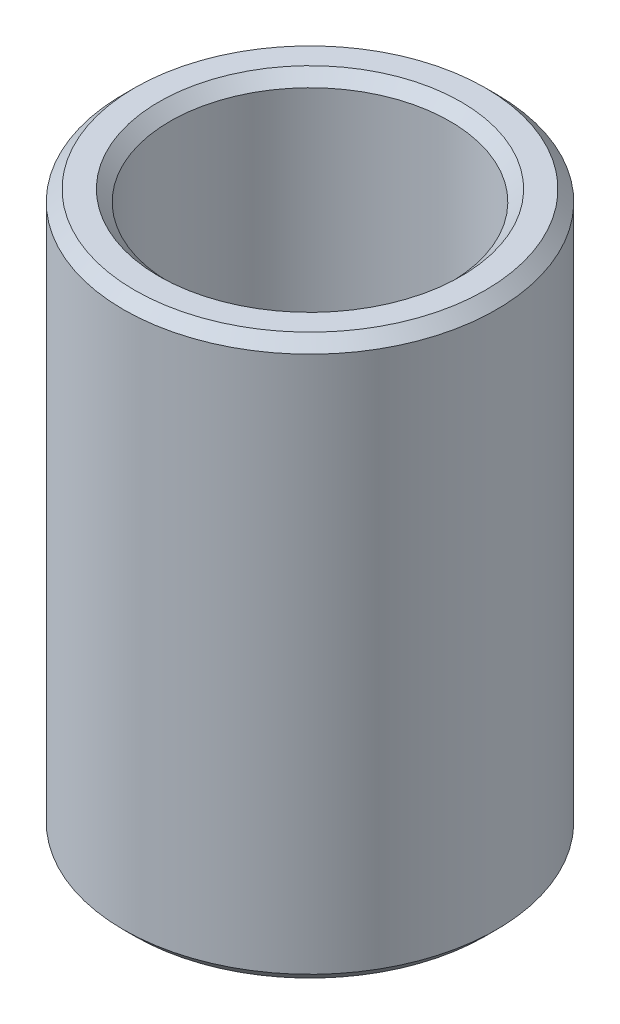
ISO-10303-21;
HEADER;
FILE_DESCRIPTION(('STEP AP214'),'2;1');
FILE_NAME('part.step','',(''),(''),'','','');
FILE_SCHEMA(('AUTOMOTIVE_DESIGN { 1 0 10303 214 1 1 1 1 }'));
ENDSEC;
DATA;
#1=APPLICATION_CONTEXT('core data for automotive mechanical design processes');
#2=APPLICATION_PROTOCOL_DEFINITION('international standard','automotive_design',2000,#1);
#3=PRODUCT_CONTEXT('',#1,'mechanical');
#4=PRODUCT('Part','Part','',(#3));
#5=PRODUCT_RELATED_PRODUCT_CATEGORY('part','',(#4));
#6=PRODUCT_DEFINITION_FORMATION('','',#4);
#7=PRODUCT_DEFINITION_CONTEXT('part definition',#1,'design');
#8=PRODUCT_DEFINITION('design','',#6,#7);
#9=PRODUCT_DEFINITION_SHAPE('','',#8);
#10=(LENGTH_UNIT() NAMED_UNIT(*) SI_UNIT(.MILLI.,.METRE.));
#11=(NAMED_UNIT(*) PLANE_ANGLE_UNIT() SI_UNIT($,.RADIAN.));
#12=(NAMED_UNIT(*) SI_UNIT($,.STERADIAN.) SOLID_ANGLE_UNIT());
#13=UNCERTAINTY_MEASURE_WITH_UNIT(LENGTH_MEASURE(1.E-05),#10,'distance_accuracy_value','');
#14=(GEOMETRIC_REPRESENTATION_CONTEXT(3) GLOBAL_UNCERTAINTY_ASSIGNED_CONTEXT((#13)) GLOBAL_UNIT_ASSIGNED_CONTEXT((#10,
#11,#12)) REPRESENTATION_CONTEXT('',''));
#15=CARTESIAN_POINT('',(0.,0.,0.));
#16=DIRECTION('',(0.,0.,1.));
#17=DIRECTION('',(1.,0.,0.));
#18=AXIS2_PLACEMENT_3D('',#15,#16,#17);
#19=CARTESIAN_POINT('',(0.,76.2,0.));
#20=DIRECTION('',(0.,1.,0.));
#21=DIRECTION('',(0.,0.,1.));
#22=AXIS2_PLACEMENT_3D('',#19,#20,#21);
#23=PLANE('',#22);
#24=CARTESIAN_POINT('',(0.,76.2,0.));
#25=DIRECTION('',(0.,1.,0.));
#26=DIRECTION('',(0.,0.,1.));
#27=AXIS2_PLACEMENT_3D('',#24,#25,#26);
#28=CIRCLE('',#27,23.8823500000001);
#29=CARTESIAN_POINT('',(0.,76.2,23.8823500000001));
#30=VERTEX_POINT('',#29);
#31=EDGE_CURVE('E54',#30,#30,#28,.T.);
#32=ORIENTED_EDGE('',*,*,#31,.T.);
#33=EDGE_LOOP('',(#32));
#34=FACE_BOUND('',#33,.T.);
#35=CARTESIAN_POINT('',(0.,76.2,0.));
#36=DIRECTION('',(0.,1.,0.));
#37=DIRECTION('',(0.,0.,1.));
#38=AXIS2_PLACEMENT_3D('',#35,#36,#37);
#39=CIRCLE('',#38,20.58035);
#40=CARTESIAN_POINT('',(0.,76.2,20.58035));
#41=VERTEX_POINT('',#40);
#42=EDGE_CURVE('E57',#41,#41,#39,.F.);
#43=ORIENTED_EDGE('',*,*,#42,.T.);
#44=EDGE_LOOP('',(#43));
#45=FACE_BOUND('',#44,.T.);
#46=ADVANCED_FACE('F28',(#34,#45),#23,.T.);
#47=CARTESIAN_POINT('',(0.,0.,0.));
#48=DIRECTION('',(0.,1.,0.));
#49=DIRECTION('',(0.,0.,1.));
#50=AXIS2_PLACEMENT_3D('',#47,#48,#49);
#51=PLANE('',#50);
#52=CARTESIAN_POINT('',(0.,0.,0.));
#53=DIRECTION('',(0.,1.,0.));
#54=DIRECTION('',(0.,0.,1.));
#55=AXIS2_PLACEMENT_3D('',#52,#53,#54);
#56=CIRCLE('',#55,23.8823499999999);
#57=CARTESIAN_POINT('',(0.,0.,23.8823499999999));
#58=VERTEX_POINT('',#57);
#59=EDGE_CURVE('E39',#58,#58,#56,.F.);
#60=ORIENTED_EDGE('',*,*,#59,.T.);
#61=EDGE_LOOP('',(#60));
#62=FACE_BOUND('',#61,.T.);
#63=CARTESIAN_POINT('',(0.,0.,0.));
#64=DIRECTION('',(0.,1.,0.));
#65=DIRECTION('',(0.,0.,1.));
#66=AXIS2_PLACEMENT_3D('',#63,#64,#65);
#67=CIRCLE('',#66,20.58035);
#68=CARTESIAN_POINT('',(0.,0.,20.58035));
#69=VERTEX_POINT('',#68);
#70=EDGE_CURVE('E43',#69,#69,#67,.T.);
#71=ORIENTED_EDGE('',*,*,#70,.T.);
#72=EDGE_LOOP('',(#71));
#73=FACE_BOUND('',#72,.T.);
#74=ADVANCED_FACE('F71',(#62,#73),#51,.F.);
#75=CARTESIAN_POINT('',(0.,76.2,0.));
#76=DIRECTION('',(0.,-1.,0.));
#77=DIRECTION('',(0.,0.,-1.));
#78=AXIS2_PLACEMENT_3D('',#75,#76,#77);
#79=CYLINDRICAL_SURFACE('',#78,25.40635);
#80=CARTESIAN_POINT('',(0.,74.6760000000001,0.));
#81=DIRECTION('',(0.,1.,0.));
#82=DIRECTION('',(0.,0.,1.));
#83=AXIS2_PLACEMENT_3D('',#80,#81,#82);
#84=CIRCLE('',#83,25.40635);
#85=CARTESIAN_POINT('',(0.,74.6760000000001,-25.40635));
#86=VERTEX_POINT('',#85);
#87=EDGE_CURVE('E48',#86,#86,#84,.F.);
#88=CARTESIAN_POINT('',(0.,1.52400000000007,0.));
#89=DIRECTION('',(0.,1.,0.));
#90=DIRECTION('',(0.,0.,1.));
#91=AXIS2_PLACEMENT_3D('',#88,#89,#90);
#92=CIRCLE('',#91,25.40635);
#93=CARTESIAN_POINT('',(0.,1.52400000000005,-25.40635));
#94=VERTEX_POINT('',#93);
#95=EDGE_CURVE('E51',#94,#94,#92,.T.);
#96=CARTESIAN_POINT('',(0.,74.6760000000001,-25.40635));
#97=CARTESIAN_POINT('',(0.,73.9140000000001,-25.40635));
#98=CARTESIAN_POINT('',(0.,73.1520000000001,-25.40635));
#99=CARTESIAN_POINT('',(0.,71.6280000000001,-25.40635));
#100=CARTESIAN_POINT('',(0.,70.8660000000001,-25.40635));
#101=CARTESIAN_POINT('',(0.,69.3420000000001,-25.40635));
#102=CARTESIAN_POINT('',(0.,68.5800000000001,-25.40635));
#103=CARTESIAN_POINT('',(0.,67.0560000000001,-25.40635));
#104=CARTESIAN_POINT('',(0.,66.2940000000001,-25.40635));
#105=CARTESIAN_POINT('',(0.,64.7700000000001,-25.40635));
#106=CARTESIAN_POINT('',(0.,64.0080000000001,-25.40635));
#107=CARTESIAN_POINT('',(0.,62.4840000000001,-25.40635));
#108=CARTESIAN_POINT('',(0.,61.7220000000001,-25.40635));
#109=CARTESIAN_POINT('',(0.,60.1980000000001,-25.40635));
#110=CARTESIAN_POINT('',(0.,59.4360000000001,-25.40635));
#111=CARTESIAN_POINT('',(0.,57.9120000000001,-25.40635));
#112=CARTESIAN_POINT('',(0.,57.1500000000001,-25.40635));
#113=CARTESIAN_POINT('',(0.,55.6260000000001,-25.40635));
#114=CARTESIAN_POINT('',(0.,54.8640000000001,-25.40635));
#115=CARTESIAN_POINT('',(0.,53.3400000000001,-25.40635));
#116=CARTESIAN_POINT('',(0.,52.5780000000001,-25.40635));
#117=CARTESIAN_POINT('',(0.,51.0540000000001,-25.40635));
#118=CARTESIAN_POINT('',(0.,50.2920000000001,-25.40635));
#119=CARTESIAN_POINT('',(0.,48.7680000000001,-25.40635));
#120=CARTESIAN_POINT('',(0.,48.0060000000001,-25.40635));
#121=CARTESIAN_POINT('',(0.,46.4820000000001,-25.40635));
#122=CARTESIAN_POINT('',(0.,45.7200000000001,-25.40635));
#123=CARTESIAN_POINT('',(0.,44.1960000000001,-25.40635));
#124=CARTESIAN_POINT('',(0.,43.4340000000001,-25.40635));
#125=CARTESIAN_POINT('',(0.,41.9100000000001,-25.40635));
#126=CARTESIAN_POINT('',(0.,41.1480000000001,-25.40635));
#127=CARTESIAN_POINT('',(0.,39.6240000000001,-25.40635));
#128=CARTESIAN_POINT('',(0.,38.8620000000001,-25.40635));
#129=CARTESIAN_POINT('',(0.,37.3380000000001,-25.40635));
#130=CARTESIAN_POINT('',(0.,36.5760000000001,-25.40635));
#131=CARTESIAN_POINT('',(0.,35.0520000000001,-25.40635));
#132=CARTESIAN_POINT('',(0.,34.2900000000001,-25.40635));
#133=CARTESIAN_POINT('',(0.,32.7660000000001,-25.40635));
#134=CARTESIAN_POINT('',(0.,32.0040000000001,-25.40635));
#135=CARTESIAN_POINT('',(0.,30.4800000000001,-25.40635));
#136=CARTESIAN_POINT('',(0.,29.7180000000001,-25.40635));
#137=CARTESIAN_POINT('',(0.,28.1940000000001,-25.40635));
#138=CARTESIAN_POINT('',(0.,27.4320000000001,-25.40635));
#139=CARTESIAN_POINT('',(0.,25.9080000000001,-25.40635));
#140=CARTESIAN_POINT('',(0.,25.1460000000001,-25.40635));
#141=CARTESIAN_POINT('',(0.,23.6220000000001,-25.40635));
#142=CARTESIAN_POINT('',(0.,22.8600000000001,-25.40635));
#143=CARTESIAN_POINT('',(0.,21.3360000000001,-25.40635));
#144=CARTESIAN_POINT('',(0.,20.5740000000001,-25.40635));
#145=CARTESIAN_POINT('',(0.,19.0500000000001,-25.40635));
#146=CARTESIAN_POINT('',(0.,18.2880000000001,-25.40635));
#147=CARTESIAN_POINT('',(0.,16.7640000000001,-25.40635));
#148=CARTESIAN_POINT('',(0.,16.0020000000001,-25.40635));
#149=CARTESIAN_POINT('',(0.,14.4780000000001,-25.40635));
#150=CARTESIAN_POINT('',(0.,13.7160000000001,-25.40635));
#151=CARTESIAN_POINT('',(0.,12.1920000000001,-25.40635));
#152=CARTESIAN_POINT('',(0.,11.4300000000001,-25.40635));
#153=CARTESIAN_POINT('',(0.,9.90600000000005,-25.40635));
#154=CARTESIAN_POINT('',(0.,9.14400000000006,-25.40635));
#155=CARTESIAN_POINT('',(0.,7.62000000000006,-25.40635));
#156=CARTESIAN_POINT('',(0.,6.85800000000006,-25.40635));
#157=CARTESIAN_POINT('',(0.,5.33400000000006,-25.40635));
#158=CARTESIAN_POINT('',(0.,4.57200000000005,-25.40635));
#159=CARTESIAN_POINT('',(0.,3.04800000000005,-25.40635));
#160=CARTESIAN_POINT('',(0.,2.28600000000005,-25.40635));
#161=CARTESIAN_POINT('',(0.,1.52400000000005,-25.40635));
#162=B_SPLINE_CURVE_WITH_KNOTS('',3,(#96,#97,#98,#99,#100,#101,#102,#103,#104,#105,#106,#107,
#108,#109,#110,#111,#112,#113,#114,#115,#116,#117,#118,#119,#120,#121,#122,#123,#124,#125,#126,
#127,#128,#129,#130,#131,#132,#133,#134,#135,#136,#137,#138,#139,#140,#141,#142,#143,#144,#145,
#146,#147,#148,#149,#150,#151,#152,#153,#154,#155,#156,#157,#158,#159,#160,#161),.UNSPECIFIED.,
.F.,.F.,(4,2,2,2,2,2,2,2,2,2,2,2,2,2,2,2,2,2,2,2,2,2,2,2,2,2,2,2,2,2,2,2,4),(0.,2.286,
4.57199999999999,6.85799999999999,9.144,11.43,13.716,16.002,18.288,20.574,22.86,25.146,27.432,
29.718,32.004,34.29,36.576,38.862,41.148,43.434,45.72,48.006,50.292,52.578,54.864,57.15,59.436,
61.722,64.008,66.294,68.58,70.866,73.152),.UNSPECIFIED.);
#163=EDGE_CURVE('BSEAM77',#86,#94,#162,.T.);
#164=ORIENTED_EDGE('',*,*,#87,.T.);
#165=ORIENTED_EDGE('',*,*,#95,.T.);
#166=ORIENTED_EDGE('',*,*,#163,.T.);
#167=ORIENTED_EDGE('',*,*,#163,.F.);
#168=EDGE_LOOP('',(#164,#166,#165,#167));
#169=FACE_BOUND('',#168,.T.);
#170=ADVANCED_FACE('F77',(#169),#79,.T.);
#171=CARTESIAN_POINT('',(0.,0.,0.));
#172=DIRECTION('',(0.,1.,0.));
#173=DIRECTION('',(0.,0.,1.));
#174=AXIS2_PLACEMENT_3D('',#171,#172,#173);
#175=CYLINDRICAL_SURFACE('',#174,19.05635);
#176=CARTESIAN_POINT('',(0.,1.52400000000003,0.));
#177=DIRECTION('',(0.,1.,0.));
#178=DIRECTION('',(0.,0.,1.));
#179=AXIS2_PLACEMENT_3D('',#176,#177,#178);
#180=CIRCLE('',#179,19.05635);
#181=CARTESIAN_POINT('',(0.,1.52400000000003,19.05635));
#182=VERTEX_POINT('',#181);
#183=EDGE_CURVE('E10',#182,#182,#180,.F.);
#184=CARTESIAN_POINT('',(0.,74.676,0.));
#185=DIRECTION('',(0.,1.,0.));
#186=DIRECTION('',(0.,0.,1.));
#187=AXIS2_PLACEMENT_3D('',#184,#185,#186);
#188=CIRCLE('',#187,19.05635);
#189=CARTESIAN_POINT('',(0.,74.676,19.05635));
#190=VERTEX_POINT('',#189);
#191=EDGE_CURVE('E35',#190,#190,#188,.T.);
#192=CARTESIAN_POINT('',(0.,1.52400000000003,19.05635));
#193=CARTESIAN_POINT('',(0.,2.28600000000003,19.05635));
#194=CARTESIAN_POINT('',(0.,3.04800000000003,19.05635));
#195=CARTESIAN_POINT('',(0.,4.57200000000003,19.05635));
#196=CARTESIAN_POINT('',(0.,5.33400000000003,19.05635));
#197=CARTESIAN_POINT('',(0.,6.85800000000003,19.05635));
#198=CARTESIAN_POINT('',(0.,7.62000000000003,19.05635));
#199=CARTESIAN_POINT('',(0.,9.14400000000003,19.05635));
#200=CARTESIAN_POINT('',(0.,9.90600000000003,19.05635));
#201=CARTESIAN_POINT('',(0.,11.43,19.05635));
#202=CARTESIAN_POINT('',(0.,12.192,19.05635));
#203=CARTESIAN_POINT('',(0.,13.716,19.05635));
#204=CARTESIAN_POINT('',(0.,14.478,19.05635));
#205=CARTESIAN_POINT('',(0.,16.002,19.05635));
#206=CARTESIAN_POINT('',(0.,16.764,19.05635));
#207=CARTESIAN_POINT('',(0.,18.288,19.05635));
#208=CARTESIAN_POINT('',(0.,19.05,19.05635));
#209=CARTESIAN_POINT('',(0.,20.574,19.05635));
#210=CARTESIAN_POINT('',(0.,21.336,19.05635));
#211=CARTESIAN_POINT('',(0.,22.86,19.05635));
#212=CARTESIAN_POINT('',(0.,23.622,19.05635));
#213=CARTESIAN_POINT('',(0.,25.146,19.05635));
#214=CARTESIAN_POINT('',(0.,25.908,19.05635));
#215=CARTESIAN_POINT('',(0.,27.432,19.05635));
#216=CARTESIAN_POINT('',(0.,28.194,19.05635));
#217=CARTESIAN_POINT('',(0.,29.718,19.05635));
#218=CARTESIAN_POINT('',(0.,30.48,19.05635));
#219=CARTESIAN_POINT('',(0.,32.004,19.05635));
#220=CARTESIAN_POINT('',(0.,32.766,19.05635));
#221=CARTESIAN_POINT('',(0.,34.29,19.05635));
#222=CARTESIAN_POINT('',(0.,35.052,19.05635));
#223=CARTESIAN_POINT('',(0.,36.576,19.05635));
#224=CARTESIAN_POINT('',(0.,37.338,19.05635));
#225=CARTESIAN_POINT('',(0.,38.862,19.05635));
#226=CARTESIAN_POINT('',(0.,39.624,19.05635));
#227=CARTESIAN_POINT('',(0.,41.148,19.05635));
#228=CARTESIAN_POINT('',(0.,41.91,19.05635));
#229=CARTESIAN_POINT('',(0.,43.434,19.05635));
#230=CARTESIAN_POINT('',(0.,44.196,19.05635));
#231=CARTESIAN_POINT('',(0.,45.72,19.05635));
#232=CARTESIAN_POINT('',(0.,46.482,19.05635));
#233=CARTESIAN_POINT('',(0.,48.006,19.05635));
#234=CARTESIAN_POINT('',(0.,48.768,19.05635));
#235=CARTESIAN_POINT('',(0.,50.292,19.05635));
#236=CARTESIAN_POINT('',(0.,51.054,19.05635));
#237=CARTESIAN_POINT('',(0.,52.578,19.05635));
#238=CARTESIAN_POINT('',(0.,53.34,19.05635));
#239=CARTESIAN_POINT('',(0.,54.864,19.05635));
#240=CARTESIAN_POINT('',(0.,55.626,19.05635));
#241=CARTESIAN_POINT('',(0.,57.15,19.05635));
#242=CARTESIAN_POINT('',(0.,57.912,19.05635));
#243=CARTESIAN_POINT('',(0.,59.436,19.05635));
#244=CARTESIAN_POINT('',(0.,60.198,19.05635));
#245=CARTESIAN_POINT('',(0.,61.722,19.05635));
#246=CARTESIAN_POINT('',(0.,62.484,19.05635));
#247=CARTESIAN_POINT('',(0.,64.008,19.05635));
#248=CARTESIAN_POINT('',(0.,64.77,19.05635));
#249=CARTESIAN_POINT('',(0.,66.294,19.05635));
#250=CARTESIAN_POINT('',(0.,67.056,19.05635));
#251=CARTESIAN_POINT('',(0.,68.58,19.05635));
#252=CARTESIAN_POINT('',(0.,69.342,19.05635));
#253=CARTESIAN_POINT('',(0.,70.866,19.05635));
#254=CARTESIAN_POINT('',(0.,71.628,19.05635));
#255=CARTESIAN_POINT('',(0.,73.152,19.05635));
#256=CARTESIAN_POINT('',(0.,73.914,19.05635));
#257=CARTESIAN_POINT('',(0.,74.676,19.05635));
#258=B_SPLINE_CURVE_WITH_KNOTS('',3,(#192,#193,#194,#195,#196,#197,#198,#199,#200,#201,#202,
#203,#204,#205,#206,#207,#208,#209,#210,#211,#212,#213,#214,#215,#216,#217,#218,#219,#220,#221,
#222,#223,#224,#225,#226,#227,#228,#229,#230,#231,#232,#233,#234,#235,#236,#237,#238,#239,#240,
#241,#242,#243,#244,#245,#246,#247,#248,#249,#250,#251,#252,#253,#254,#255,#256,#257),
.UNSPECIFIED.,.F.,.F.,(4,2,2,2,2,2,2,2,2,2,2,2,2,2,2,2,2,2,2,2,2,2,2,2,2,2,2,2,2,2,2,2,4),(0.,
2.286,4.572,6.858,9.144,11.43,13.716,16.002,18.288,20.574,22.86,25.146,27.432,29.718,32.004,
34.29,36.576,38.862,41.148,43.434,45.72,48.006,50.292,52.578,54.864,57.15,59.436,61.722,64.008,
66.294,68.58,70.866,73.152),.UNSPECIFIED.);
#259=EDGE_CURVE('BSEAM81',#182,#190,#258,.T.);
#260=ORIENTED_EDGE('',*,*,#183,.T.);
#261=ORIENTED_EDGE('',*,*,#191,.T.);
#262=ORIENTED_EDGE('',*,*,#259,.T.);
#263=ORIENTED_EDGE('',*,*,#259,.F.);
#264=EDGE_LOOP('',(#260,#262,#261,#263));
#265=FACE_BOUND('',#264,.T.);
#266=ADVANCED_FACE('F81',(#265),#175,.F.);
#267=CARTESIAN_POINT('',(0.,76.2,0.));
#268=DIRECTION('',(0.,-1.,0.));
#269=DIRECTION('',(0.,0.,-1.));
#270=AXIS2_PLACEMENT_3D('',#267,#268,#269);
#271=CONICAL_SURFACE('',#270,23.8823500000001,0.785398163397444);
#272=ORIENTED_EDGE('',*,*,#87,.F.);
#273=EDGE_LOOP('',(#272));
#274=FACE_BOUND('',#273,.T.);
#275=ORIENTED_EDGE('',*,*,#31,.F.);
#276=EDGE_LOOP('',(#275));
#277=FACE_BOUND('',#276,.T.);
#278=ADVANCED_FACE('F86',(#274,#277),#271,.T.);
#279=CARTESIAN_POINT('',(0.,1.52400000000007,0.));
#280=DIRECTION('',(0.,1.,0.));
#281=DIRECTION('',(0.,0.,1.));
#282=AXIS2_PLACEMENT_3D('',#279,#280,#281);
#283=CONICAL_SURFACE('',#282,25.40635,0.785398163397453);
#284=ORIENTED_EDGE('',*,*,#59,.F.);
#285=EDGE_LOOP('',(#284));
#286=FACE_BOUND('',#285,.T.);
#287=ORIENTED_EDGE('',*,*,#95,.F.);
#288=EDGE_LOOP('',(#287));
#289=FACE_BOUND('',#288,.T.);
#290=ADVANCED_FACE('F68',(#286,#289),#283,.T.);
#291=CARTESIAN_POINT('',(0.,1.52400000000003,0.));
#292=DIRECTION('',(0.,-1.,0.));
#293=DIRECTION('',(0.,0.,-1.));
#294=AXIS2_PLACEMENT_3D('',#291,#292,#293);
#295=CONICAL_SURFACE('',#294,19.05635,0.785398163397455);
#296=ORIENTED_EDGE('',*,*,#70,.F.);
#297=EDGE_LOOP('',(#296));
#298=FACE_BOUND('',#297,.T.);
#299=ORIENTED_EDGE('',*,*,#183,.F.);
#300=EDGE_LOOP('',(#299));
#301=FACE_BOUND('',#300,.T.);
#302=ADVANCED_FACE('F63',(#298,#301),#295,.F.);
#303=CARTESIAN_POINT('',(0.,76.2,0.));
#304=DIRECTION('',(0.,1.,0.));
#305=DIRECTION('',(0.,0.,1.));
#306=AXIS2_PLACEMENT_3D('',#303,#304,#305);
#307=CONICAL_SURFACE('',#306,20.58035,0.785398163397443);
#308=ORIENTED_EDGE('',*,*,#191,.F.);
#309=EDGE_LOOP('',(#308));
#310=FACE_BOUND('',#309,.T.);
#311=ORIENTED_EDGE('',*,*,#42,.F.);
#312=EDGE_LOOP('',(#311));
#313=FACE_BOUND('',#312,.T.);
#314=ADVANCED_FACE('F30',(#310,#313),#307,.F.);
#315=CLOSED_SHELL('',(#46,#74,#170,#266,#278,#290,#302,#314));
#316=MANIFOLD_SOLID_BREP('B2',#315);
#317=ADVANCED_BREP_SHAPE_REPRESENTATION('',(#18,#316),#14);
#318=SHAPE_DEFINITION_REPRESENTATION(#9,#317);
ENDSEC;
END-ISO-10303-21;
